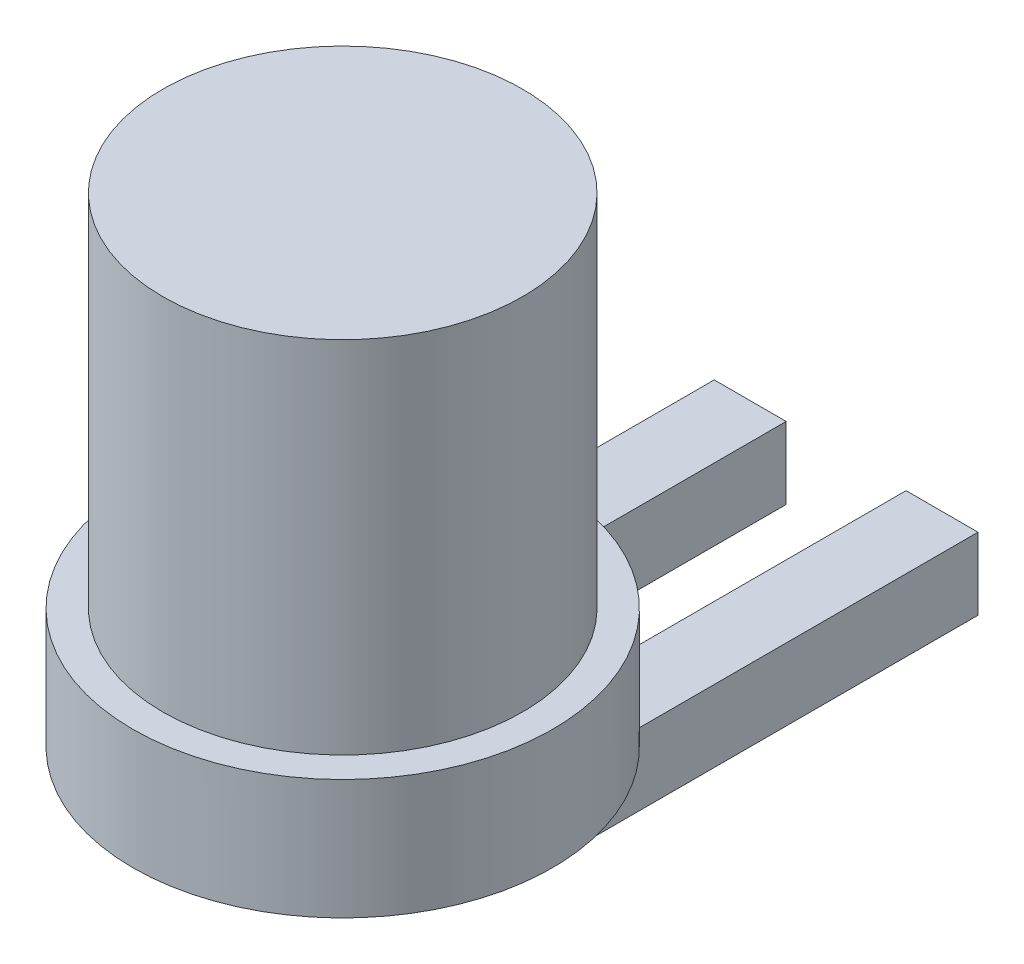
ISO-10303-21;
HEADER;
FILE_DESCRIPTION(('STEP AP214'),'2;1');
FILE_NAME('part.step','',(''),(''),'','','');
FILE_SCHEMA(('AUTOMOTIVE_DESIGN { 1 0 10303 214 1 1 1 1 }'));
ENDSEC;
DATA;
#1=APPLICATION_CONTEXT('core data for automotive mechanical design processes');
#2=APPLICATION_PROTOCOL_DEFINITION('international standard','automotive_design',2000,#1);
#3=PRODUCT_CONTEXT('',#1,'mechanical');
#4=PRODUCT('Part','Part','',(#3));
#5=PRODUCT_RELATED_PRODUCT_CATEGORY('part','',(#4));
#6=PRODUCT_DEFINITION_FORMATION('','',#4);
#7=PRODUCT_DEFINITION_CONTEXT('part definition',#1,'design');
#8=PRODUCT_DEFINITION('design','',#6,#7);
#9=PRODUCT_DEFINITION_SHAPE('','',#8);
#10=(LENGTH_UNIT() NAMED_UNIT(*) SI_UNIT(.MILLI.,.METRE.));
#11=(NAMED_UNIT(*) PLANE_ANGLE_UNIT() SI_UNIT($,.RADIAN.));
#12=(NAMED_UNIT(*) SI_UNIT($,.STERADIAN.) SOLID_ANGLE_UNIT());
#13=UNCERTAINTY_MEASURE_WITH_UNIT(LENGTH_MEASURE(1.E-05),#10,'distance_accuracy_value','');
#14=(GEOMETRIC_REPRESENTATION_CONTEXT(3) GLOBAL_UNCERTAINTY_ASSIGNED_CONTEXT((#13)) GLOBAL_UNIT_ASSIGNED_CONTEXT((#10,
#11,#12)) REPRESENTATION_CONTEXT('',''));
#15=CARTESIAN_POINT('',(0.,0.,0.));
#16=DIRECTION('',(0.,0.,1.));
#17=DIRECTION('',(1.,0.,0.));
#18=AXIS2_PLACEMENT_3D('',#15,#16,#17);
#19=CARTESIAN_POINT('',(0.,0.,0.));
#20=DIRECTION('',(0.,-1.,0.));
#21=DIRECTION('',(0.,0.,-1.));
#22=AXIS2_PLACEMENT_3D('',#19,#20,#21);
#23=PLANE('',#22);
#24=CARTESIAN_POINT('',(0.,0.,0.));
#25=DIRECTION('',(0.,1.,0.));
#26=DIRECTION('',(0.,0.,1.));
#27=AXIS2_PLACEMENT_3D('',#24,#25,#26);
#28=CIRCLE('',#27,1.74999999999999);
#29=CARTESIAN_POINT('',(0.5,0.,-1.67705098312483));
#30=VERTEX_POINT('',#29);
#31=CARTESIAN_POINT('',(-0.5,0.,-1.67705098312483));
#32=VERTEX_POINT('',#31);
#33=EDGE_CURVE('E168',#30,#32,#28,.T.);
#34=ORIENTED_EDGE('',*,*,#33,.F.);
#35=DIRECTION('',(0.,0.,-1.));
#36=VECTOR('',#35,1.);
#37=CARTESIAN_POINT('',(0.5,0.,0.408605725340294));
#38=LINE('',#37,#36);
#39=CARTESIAN_POINT('',(0.5,0.,0.408605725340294));
#40=VERTEX_POINT('',#39);
#41=EDGE_CURVE('E181',#40,#30,#38,.T.);
#42=ORIENTED_EDGE('',*,*,#41,.F.);
#43=DIRECTION('',(-1.,0.,0.));
#44=VECTOR('',#43,1.);
#45=CARTESIAN_POINT('',(0.5,0.,0.408605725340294));
#46=LINE('',#45,#44);
#47=CARTESIAN_POINT('',(1.1,0.,0.408605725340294));
#48=VERTEX_POINT('',#47);
#49=EDGE_CURVE('E115',#48,#40,#46,.T.);
#50=ORIENTED_EDGE('',*,*,#49,.F.);
#51=DIRECTION('',(0.,0.,1.));
#52=VECTOR('',#51,1.);
#53=CARTESIAN_POINT('',(1.1,0.,0.408605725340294));
#54=LINE('',#53,#52);
#55=CARTESIAN_POINT('',(1.1,0.,-1.36106575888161));
#56=VERTEX_POINT('',#55);
#57=EDGE_CURVE('E192',#56,#48,#54,.T.);
#58=ORIENTED_EDGE('',*,*,#57,.F.);
#59=CARTESIAN_POINT('',(-1.1,0.,-1.36106575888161));
#60=VERTEX_POINT('',#59);
#61=EDGE_CURVE('E172',#60,#56,#28,.T.);
#62=ORIENTED_EDGE('',*,*,#61,.F.);
#63=DIRECTION('',(0.,0.,-1.));
#64=VECTOR('',#63,1.);
#65=CARTESIAN_POINT('',(-1.1,0.,0.408605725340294));
#66=LINE('',#65,#64);
#67=CARTESIAN_POINT('',(-1.1,0.,0.408605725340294));
#68=VERTEX_POINT('',#67);
#69=EDGE_CURVE('E131',#68,#60,#66,.T.);
#70=ORIENTED_EDGE('',*,*,#69,.F.);
#71=DIRECTION('',(-1.,0.,0.));
#72=VECTOR('',#71,1.);
#73=CARTESIAN_POINT('',(-1.1,0.,0.408605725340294));
#74=LINE('',#73,#72);
#75=CARTESIAN_POINT('',(-0.5,0.,0.408605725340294));
#76=VERTEX_POINT('',#75);
#77=EDGE_CURVE('E139',#76,#68,#74,.T.);
#78=ORIENTED_EDGE('',*,*,#77,.F.);
#79=DIRECTION('',(0.,0.,1.));
#80=VECTOR('',#79,1.);
#81=CARTESIAN_POINT('',(-0.5,0.,0.408605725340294));
#82=LINE('',#81,#80);
#83=EDGE_CURVE('E151',#32,#76,#82,.T.);
#84=ORIENTED_EDGE('',*,*,#83,.F.);
#85=EDGE_LOOP('',(#34,#42,#50,#58,#62,#70,#78,#84));
#86=FACE_BOUND('',#85,.T.);
#87=ADVANCED_FACE('F32',(#86),#23,.T.);
#88=CARTESIAN_POINT('',(0.,65.1369688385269,0.));
#89=DIRECTION('',(0.,1.,0.));
#90=DIRECTION('',(0.,0.,1.));
#91=AXIS2_PLACEMENT_3D('',#88,#89,#90);
#92=CYLINDRICAL_SURFACE('',#91,1.74999999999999);
#93=EDGE_CURVE('E169',#32,#60,#28,.T.);
#94=ORIENTED_EDGE('',*,*,#93,.T.);
#95=ORIENTED_EDGE('',*,*,#61,.T.);
#96=EDGE_CURVE('E200',#56,#30,#28,.T.);
#97=ORIENTED_EDGE('',*,*,#96,.T.);
#98=ORIENTED_EDGE('',*,*,#33,.T.);
#99=EDGE_LOOP('',(#94,#95,#97,#98));
#100=FACE_BOUND('',#99,.T.);
#101=CARTESIAN_POINT('',(0.,1.,0.));
#102=DIRECTION('',(0.,1.,0.));
#103=DIRECTION('',(0.,0.,1.));
#104=AXIS2_PLACEMENT_3D('',#101,#102,#103);
#105=CIRCLE('',#104,1.74999999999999);
#106=CARTESIAN_POINT('',(0.,1.,1.74999999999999));
#107=VERTEX_POINT('',#106);
#108=EDGE_CURVE('E165',#107,#107,#105,.T.);
#109=ORIENTED_EDGE('',*,*,#108,.F.);
#110=EDGE_LOOP('',(#109));
#111=FACE_BOUND('',#110,.T.);
#112=ADVANCED_FACE('F203',(#100,#111),#92,.T.);
#113=CARTESIAN_POINT('',(-1.74999999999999,1.,0.));
#114=DIRECTION('',(0.,1.,0.));
#115=DIRECTION('',(0.,0.,1.));
#116=AXIS2_PLACEMENT_3D('',#113,#114,#115);
#117=PLANE('',#116);
#118=ORIENTED_EDGE('',*,*,#108,.T.);
#119=EDGE_LOOP('',(#118));
#120=FACE_BOUND('',#119,.T.);
#121=CARTESIAN_POINT('',(0.,1.,0.));
#122=DIRECTION('',(0.,1.,0.));
#123=DIRECTION('',(0.,0.,1.));
#124=AXIS2_PLACEMENT_3D('',#121,#122,#123);
#125=CIRCLE('',#124,1.49999999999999);
#126=CARTESIAN_POINT('',(0.,1.,1.49999999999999));
#127=VERTEX_POINT('',#126);
#128=EDGE_CURVE('E162',#127,#127,#125,.T.);
#129=ORIENTED_EDGE('',*,*,#128,.F.);
#130=EDGE_LOOP('',(#129));
#131=FACE_BOUND('',#130,.T.);
#132=ADVANCED_FACE('F244',(#120,#131),#117,.T.);
#133=CARTESIAN_POINT('',(0.,65.1369688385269,0.));
#134=DIRECTION('',(0.,1.,0.));
#135=DIRECTION('',(0.,0.,1.));
#136=AXIS2_PLACEMENT_3D('',#133,#134,#135);
#137=CYLINDRICAL_SURFACE('',#136,1.49999999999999);
#138=ORIENTED_EDGE('',*,*,#128,.T.);
#139=EDGE_LOOP('',(#138));
#140=FACE_BOUND('',#139,.T.);
#141=CARTESIAN_POINT('',(0.,4.,0.));
#142=DIRECTION('',(0.,1.,0.));
#143=DIRECTION('',(0.,0.,1.));
#144=AXIS2_PLACEMENT_3D('',#141,#142,#143);
#145=CIRCLE('',#144,1.49999999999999);
#146=CARTESIAN_POINT('',(0.,4.,1.49999999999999));
#147=VERTEX_POINT('',#146);
#148=EDGE_CURVE('E159',#147,#147,#145,.T.);
#149=ORIENTED_EDGE('',*,*,#148,.F.);
#150=EDGE_LOOP('',(#149));
#151=FACE_BOUND('',#150,.T.);
#152=ADVANCED_FACE('F350',(#140,#151),#137,.T.);
#153=CARTESIAN_POINT('',(-1.49999999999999,4.,0.));
#154=DIRECTION('',(0.,1.,0.));
#155=DIRECTION('',(0.,0.,1.));
#156=AXIS2_PLACEMENT_3D('',#153,#154,#155);
#157=PLANE('',#156);
#158=ORIENTED_EDGE('',*,*,#148,.T.);
#159=EDGE_LOOP('',(#158));
#160=FACE_BOUND('',#159,.T.);
#161=ADVANCED_FACE('F306',(#160),#157,.T.);
#162=CARTESIAN_POINT('',(-1.1,-0.6,0.408605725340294));
#163=DIRECTION('',(1.,0.,0.));
#164=DIRECTION('',(0.,0.,-1.));
#165=AXIS2_PLACEMENT_3D('',#162,#163,#164);
#166=PLANE('',#165);
#167=DIRECTION('',(0.,0.,-1.));
#168=VECTOR('',#167,1.);
#169=CARTESIAN_POINT('',(-1.1,-0.6,0.408605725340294));
#170=LINE('',#169,#168);
#171=CARTESIAN_POINT('',(-1.1,-0.6,-0.365990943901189));
#172=VERTEX_POINT('',#171);
#173=CARTESIAN_POINT('',(-1.1,-0.6,-4.19840971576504));
#174=VERTEX_POINT('',#173);
#175=EDGE_CURVE('E136',#172,#174,#170,.T.);
#176=ORIENTED_EDGE('',*,*,#175,.F.);
#177=CARTESIAN_POINT('',(-1.1,0.2,-0.365990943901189));
#178=DIRECTION('',(1.,0.,0.));
#179=DIRECTION('',(0.,0.,-1.));
#180=AXIS2_PLACEMENT_3D('',#177,#178,#179);
#181=CIRCLE('',#180,0.8);
#182=EDGE_CURVE('E176',#172,#68,#181,.F.);
#183=ORIENTED_EDGE('',*,*,#182,.T.);
#184=ORIENTED_EDGE('',*,*,#69,.T.);
#185=CARTESIAN_POINT('',(-1.1,0.,-4.19840971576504));
#186=VERTEX_POINT('',#185);
#187=EDGE_CURVE('E129',#60,#186,#66,.T.);
#188=ORIENTED_EDGE('',*,*,#187,.T.);
#189=DIRECTION('',(0.,1.,0.));
#190=VECTOR('',#189,1.);
#191=CARTESIAN_POINT('',(-1.1,-0.6,-4.19840971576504));
#192=LINE('',#191,#190);
#193=EDGE_CURVE('E156',#174,#186,#192,.T.);
#194=ORIENTED_EDGE('',*,*,#193,.F.);
#195=EDGE_LOOP('',(#176,#183,#184,#188,#194));
#196=FACE_BOUND('',#195,.T.);
#197=ADVANCED_FACE('F224',(#196),#166,.F.);
#198=CARTESIAN_POINT('',(-1.1,-0.6,-4.19840971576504));
#199=DIRECTION('',(0.,0.,1.));
#200=DIRECTION('',(1.,0.,0.));
#201=AXIS2_PLACEMENT_3D('',#198,#199,#200);
#202=PLANE('',#201);
#203=DIRECTION('',(1.,0.,0.));
#204=VECTOR('',#203,1.);
#205=CARTESIAN_POINT('',(-1.1,0.,-4.19840971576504));
#206=LINE('',#205,#204);
#207=CARTESIAN_POINT('',(-0.499999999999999,0.,-4.19840971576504));
#208=VERTEX_POINT('',#207);
#209=EDGE_CURVE('E146',#186,#208,#206,.T.);
#210=ORIENTED_EDGE('',*,*,#209,.T.);
#211=DIRECTION('',(0.,1.,0.));
#212=VECTOR('',#211,1.);
#213=CARTESIAN_POINT('',(-0.499999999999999,-0.6,-4.19840971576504));
#214=LINE('',#213,#212);
#215=CARTESIAN_POINT('',(-0.499999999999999,-0.6,-4.19840971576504));
#216=VERTEX_POINT('',#215);
#217=EDGE_CURVE('E143',#216,#208,#214,.T.);
#218=ORIENTED_EDGE('',*,*,#217,.F.);
#219=DIRECTION('',(1.,0.,0.));
#220=VECTOR('',#219,1.);
#221=CARTESIAN_POINT('',(-1.1,-0.6,-4.19840971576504));
#222=LINE('',#221,#220);
#223=EDGE_CURVE('E138',#174,#216,#222,.T.);
#224=ORIENTED_EDGE('',*,*,#223,.F.);
#225=ORIENTED_EDGE('',*,*,#193,.T.);
#226=EDGE_LOOP('',(#210,#218,#224,#225));
#227=FACE_BOUND('',#226,.T.);
#228=ADVANCED_FACE('F220',(#227),#202,.F.);
#229=CARTESIAN_POINT('',(-0.5,-0.6,0.408605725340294));
#230=DIRECTION('',(-1.,0.,0.));
#231=DIRECTION('',(0.,0.,1.));
#232=AXIS2_PLACEMENT_3D('',#229,#230,#231);
#233=PLANE('',#232);
#234=ORIENTED_EDGE('',*,*,#83,.T.);
#235=CARTESIAN_POINT('',(-0.5,0.2,-0.365990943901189));
#236=DIRECTION('',(-1.,0.,0.));
#237=DIRECTION('',(0.,0.,1.));
#238=AXIS2_PLACEMENT_3D('',#235,#236,#237);
#239=CIRCLE('',#238,0.8);
#240=CARTESIAN_POINT('',(-0.5,-0.6,-0.365990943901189));
#241=VERTEX_POINT('',#240);
#242=EDGE_CURVE('E178',#76,#241,#239,.F.);
#243=ORIENTED_EDGE('',*,*,#242,.T.);
#244=DIRECTION('',(0.,0.,1.));
#245=VECTOR('',#244,1.);
#246=CARTESIAN_POINT('',(-0.5,-0.6,0.408605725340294));
#247=LINE('',#246,#245);
#248=EDGE_CURVE('E141',#216,#241,#247,.T.);
#249=ORIENTED_EDGE('',*,*,#248,.F.);
#250=ORIENTED_EDGE('',*,*,#217,.T.);
#251=EDGE_CURVE('E148',#208,#32,#82,.T.);
#252=ORIENTED_EDGE('',*,*,#251,.T.);
#253=EDGE_LOOP('',(#234,#243,#249,#250,#252));
#254=FACE_BOUND('',#253,.T.);
#255=ADVANCED_FACE('F215',(#254),#233,.F.);
#256=CARTESIAN_POINT('',(0.,-0.6,0.));
#257=DIRECTION('',(0.,-1.,0.));
#258=DIRECTION('',(0.,0.,-1.));
#259=AXIS2_PLACEMENT_3D('',#256,#257,#258);
#260=PLANE('',#259);
#261=ORIENTED_EDGE('',*,*,#248,.T.);
#262=DIRECTION('',(1.,0.,0.));
#263=VECTOR('',#262,1.);
#264=CARTESIAN_POINT('',(-1.1,-0.6,-0.365990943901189));
#265=LINE('',#264,#263);
#266=EDGE_CURVE('E173',#241,#172,#265,.F.);
#267=ORIENTED_EDGE('',*,*,#266,.T.);
#268=ORIENTED_EDGE('',*,*,#175,.T.);
#269=ORIENTED_EDGE('',*,*,#223,.T.);
#270=EDGE_LOOP('',(#261,#267,#268,#269));
#271=FACE_BOUND('',#270,.T.);
#272=ADVANCED_FACE('F229',(#271),#260,.T.);
#273=CARTESIAN_POINT('',(0.,0.,0.));
#274=DIRECTION('',(0.,-1.,0.));
#275=DIRECTION('',(0.,0.,-1.));
#276=AXIS2_PLACEMENT_3D('',#273,#274,#275);
#277=PLANE('',#276);
#278=ORIENTED_EDGE('',*,*,#93,.F.);
#279=ORIENTED_EDGE('',*,*,#251,.F.);
#280=ORIENTED_EDGE('',*,*,#209,.F.);
#281=ORIENTED_EDGE('',*,*,#187,.F.);
#282=EDGE_LOOP('',(#278,#279,#280,#281));
#283=FACE_BOUND('',#282,.T.);
#284=ADVANCED_FACE('F213',(#283),#277,.F.);
#285=CARTESIAN_POINT('',(0.5,-0.6,0.408605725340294));
#286=DIRECTION('',(1.,0.,0.));
#287=DIRECTION('',(0.,0.,-1.));
#288=AXIS2_PLACEMENT_3D('',#285,#286,#287);
#289=PLANE('',#288);
#290=DIRECTION('',(0.,0.,-1.));
#291=VECTOR('',#290,1.);
#292=CARTESIAN_POINT('',(0.5,-0.6,0.408605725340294));
#293=LINE('',#292,#291);
#294=CARTESIAN_POINT('',(0.5,-0.6,-0.365990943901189));
#295=VERTEX_POINT('',#294);
#296=CARTESIAN_POINT('',(0.500000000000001,-0.6,-4.19840971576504));
#297=VERTEX_POINT('',#296);
#298=EDGE_CURVE('E107',#295,#297,#293,.T.);
#299=ORIENTED_EDGE('',*,*,#298,.F.);
#300=CARTESIAN_POINT('',(0.5,0.2,-0.365990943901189));
#301=DIRECTION('',(1.,0.,0.));
#302=DIRECTION('',(0.,0.,-1.));
#303=AXIS2_PLACEMENT_3D('',#300,#301,#302);
#304=CIRCLE('',#303,0.8);
#305=EDGE_CURVE('E40',#295,#40,#304,.F.);
#306=ORIENTED_EDGE('',*,*,#305,.T.);
#307=ORIENTED_EDGE('',*,*,#41,.T.);
#308=CARTESIAN_POINT('',(0.500000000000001,0.,-4.19840971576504));
#309=VERTEX_POINT('',#308);
#310=EDGE_CURVE('E127',#30,#309,#38,.T.);
#311=ORIENTED_EDGE('',*,*,#310,.T.);
#312=DIRECTION('',(0.,1.,0.));
#313=VECTOR('',#312,1.);
#314=CARTESIAN_POINT('',(0.500000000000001,-0.6,-4.19840971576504));
#315=LINE('',#314,#313);
#316=EDGE_CURVE('E120',#297,#309,#315,.T.);
#317=ORIENTED_EDGE('',*,*,#316,.F.);
#318=EDGE_LOOP('',(#299,#306,#307,#311,#317));
#319=FACE_BOUND('',#318,.T.);
#320=ADVANCED_FACE('F125',(#319),#289,.F.);
#321=CARTESIAN_POINT('',(0.500000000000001,-0.6,-4.19840971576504));
#322=DIRECTION('',(0.,0.,1.));
#323=DIRECTION('',(1.,0.,0.));
#324=AXIS2_PLACEMENT_3D('',#321,#322,#323);
#325=PLANE('',#324);
#326=DIRECTION('',(1.,0.,0.));
#327=VECTOR('',#326,1.);
#328=CARTESIAN_POINT('',(0.500000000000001,0.,-4.19840971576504));
#329=LINE('',#328,#327);
#330=CARTESIAN_POINT('',(1.1,0.,-4.19840971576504));
#331=VERTEX_POINT('',#330);
#332=EDGE_CURVE('E188',#309,#331,#329,.T.);
#333=ORIENTED_EDGE('',*,*,#332,.T.);
#334=DIRECTION('',(0.,1.,0.));
#335=VECTOR('',#334,1.);
#336=CARTESIAN_POINT('',(1.1,-0.6,-4.19840971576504));
#337=LINE('',#336,#335);
#338=CARTESIAN_POINT('',(1.1,-0.6,-4.19840971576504));
#339=VERTEX_POINT('',#338);
#340=EDGE_CURVE('E122',#339,#331,#337,.T.);
#341=ORIENTED_EDGE('',*,*,#340,.F.);
#342=DIRECTION('',(1.,0.,0.));
#343=VECTOR('',#342,1.);
#344=CARTESIAN_POINT('',(0.500000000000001,-0.6,-4.19840971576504));
#345=LINE('',#344,#343);
#346=EDGE_CURVE('E110',#297,#339,#345,.T.);
#347=ORIENTED_EDGE('',*,*,#346,.F.);
#348=ORIENTED_EDGE('',*,*,#316,.T.);
#349=EDGE_LOOP('',(#333,#341,#347,#348));
#350=FACE_BOUND('',#349,.T.);
#351=ADVANCED_FACE('F119',(#350),#325,.F.);
#352=CARTESIAN_POINT('',(1.1,-0.6,0.408605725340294));
#353=DIRECTION('',(-1.,0.,0.));
#354=DIRECTION('',(0.,0.,1.));
#355=AXIS2_PLACEMENT_3D('',#352,#353,#354);
#356=PLANE('',#355);
#357=ORIENTED_EDGE('',*,*,#57,.T.);
#358=CARTESIAN_POINT('',(1.1,0.2,-0.365990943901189));
#359=DIRECTION('',(-1.,0.,0.));
#360=DIRECTION('',(0.,0.,1.));
#361=AXIS2_PLACEMENT_3D('',#358,#359,#360);
#362=CIRCLE('',#361,0.8);
#363=CARTESIAN_POINT('',(1.1,-0.6,-0.365990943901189));
#364=VERTEX_POINT('',#363);
#365=EDGE_CURVE('E11',#48,#364,#362,.F.);
#366=ORIENTED_EDGE('',*,*,#365,.T.);
#367=DIRECTION('',(0.,0.,1.));
#368=VECTOR('',#367,1.);
#369=CARTESIAN_POINT('',(1.1,-0.6,0.408605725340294));
#370=LINE('',#369,#368);
#371=EDGE_CURVE('E123',#339,#364,#370,.T.);
#372=ORIENTED_EDGE('',*,*,#371,.F.);
#373=ORIENTED_EDGE('',*,*,#340,.T.);
#374=EDGE_CURVE('E190',#331,#56,#54,.T.);
#375=ORIENTED_EDGE('',*,*,#374,.T.);
#376=EDGE_LOOP('',(#357,#366,#372,#373,#375));
#377=FACE_BOUND('',#376,.T.);
#378=ADVANCED_FACE('F196',(#377),#356,.F.);
#379=CARTESIAN_POINT('',(0.,-0.6,0.));
#380=DIRECTION('',(0.,-1.,0.));
#381=DIRECTION('',(0.,0.,-1.));
#382=AXIS2_PLACEMENT_3D('',#379,#380,#381);
#383=PLANE('',#382);
#384=ORIENTED_EDGE('',*,*,#371,.T.);
#385=DIRECTION('',(1.,0.,0.));
#386=VECTOR('',#385,1.);
#387=CARTESIAN_POINT('',(0.5,-0.6,-0.365990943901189));
#388=LINE('',#387,#386);
#389=EDGE_CURVE('E112',#364,#295,#388,.F.);
#390=ORIENTED_EDGE('',*,*,#389,.T.);
#391=ORIENTED_EDGE('',*,*,#298,.T.);
#392=ORIENTED_EDGE('',*,*,#346,.T.);
#393=EDGE_LOOP('',(#384,#390,#391,#392));
#394=FACE_BOUND('',#393,.T.);
#395=ADVANCED_FACE('F109',(#394),#383,.T.);
#396=CARTESIAN_POINT('',(0.,0.,0.));
#397=DIRECTION('',(0.,-1.,0.));
#398=DIRECTION('',(0.,0.,-1.));
#399=AXIS2_PLACEMENT_3D('',#396,#397,#398);
#400=PLANE('',#399);
#401=ORIENTED_EDGE('',*,*,#96,.F.);
#402=ORIENTED_EDGE('',*,*,#374,.F.);
#403=ORIENTED_EDGE('',*,*,#332,.F.);
#404=ORIENTED_EDGE('',*,*,#310,.F.);
#405=EDGE_LOOP('',(#401,#402,#403,#404));
#406=FACE_BOUND('',#405,.T.);
#407=ADVANCED_FACE('F199',(#406),#400,.F.);
#408=CARTESIAN_POINT('',(-1.1,0.2,-0.365990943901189));
#409=DIRECTION('',(-1.,0.,0.));
#410=DIRECTION('',(0.,0.,1.));
#411=AXIS2_PLACEMENT_3D('',#408,#409,#410);
#412=CYLINDRICAL_SURFACE('',#411,0.8);
#413=ORIENTED_EDGE('',*,*,#242,.F.);
#414=ORIENTED_EDGE('',*,*,#77,.T.);
#415=ORIENTED_EDGE('',*,*,#182,.F.);
#416=ORIENTED_EDGE('',*,*,#266,.F.);
#417=EDGE_LOOP('',(#413,#414,#415,#416));
#418=FACE_BOUND('',#417,.T.);
#419=ADVANCED_FACE('F226',(#418),#412,.T.);
#420=CARTESIAN_POINT('',(0.5,0.2,-0.365990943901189));
#421=DIRECTION('',(-1.,0.,0.));
#422=DIRECTION('',(0.,0.,1.));
#423=AXIS2_PLACEMENT_3D('',#420,#421,#422);
#424=CYLINDRICAL_SURFACE('',#423,0.8);
#425=ORIENTED_EDGE('',*,*,#365,.F.);
#426=ORIENTED_EDGE('',*,*,#49,.T.);
#427=ORIENTED_EDGE('',*,*,#305,.F.);
#428=ORIENTED_EDGE('',*,*,#389,.F.);
#429=EDGE_LOOP('',(#425,#426,#427,#428));
#430=FACE_BOUND('',#429,.T.);
#431=ADVANCED_FACE('F34',(#430),#424,.T.);
#432=CLOSED_SHELL('',(#87,#112,#132,#152,#161,#197,#228,#255,#272,#284,#320,#351,#378,#395,#407,
#419,#431));
#433=MANIFOLD_SOLID_BREP('B2',#432);
#434=ADVANCED_BREP_SHAPE_REPRESENTATION('',(#18,#433),#14);
#435=SHAPE_DEFINITION_REPRESENTATION(#9,#434);
ENDSEC;
END-ISO-10303-21;
